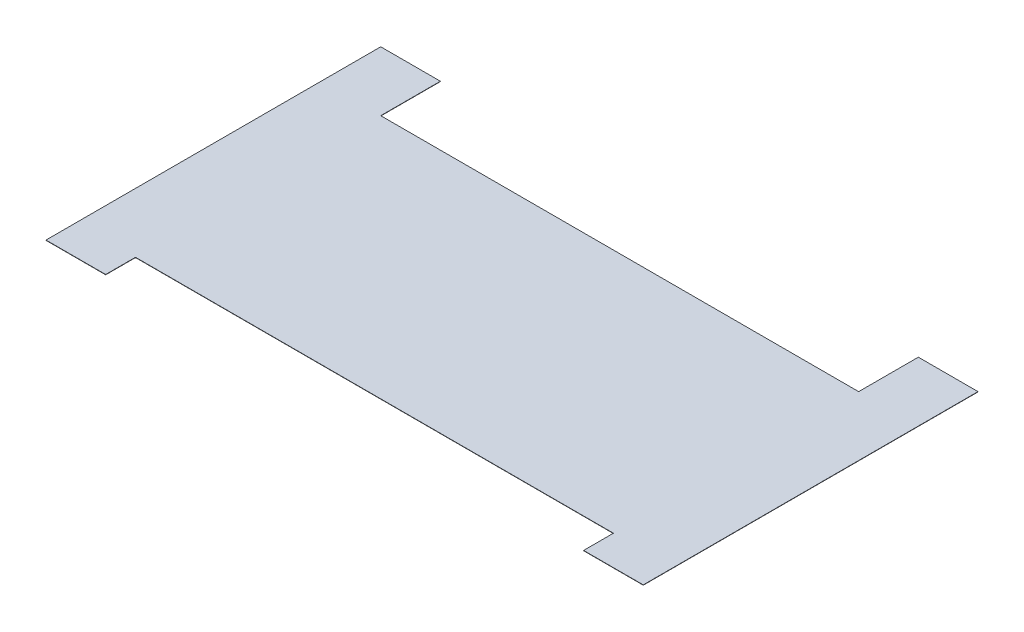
ISO-10303-21;
HEADER;
FILE_DESCRIPTION(('STEP AP214'),'2;1');
FILE_NAME('part.step','',(''),(''),'','','');
FILE_SCHEMA(('AUTOMOTIVE_DESIGN { 1 0 10303 214 1 1 1 1 }'));
ENDSEC;
DATA;
#1=APPLICATION_CONTEXT('core data for automotive mechanical design processes');
#2=APPLICATION_PROTOCOL_DEFINITION('international standard','automotive_design',2000,#1);
#3=PRODUCT_CONTEXT('',#1,'mechanical');
#4=PRODUCT('Part','Part','',(#3));
#5=PRODUCT_RELATED_PRODUCT_CATEGORY('part','',(#4));
#6=PRODUCT_DEFINITION_FORMATION('','',#4);
#7=PRODUCT_DEFINITION_CONTEXT('part definition',#1,'design');
#8=PRODUCT_DEFINITION('design','',#6,#7);
#9=PRODUCT_DEFINITION_SHAPE('','',#8);
#10=(LENGTH_UNIT() NAMED_UNIT(*) SI_UNIT(.MILLI.,.METRE.));
#11=(NAMED_UNIT(*) PLANE_ANGLE_UNIT() SI_UNIT($,.RADIAN.));
#12=(NAMED_UNIT(*) SI_UNIT($,.STERADIAN.) SOLID_ANGLE_UNIT());
#13=UNCERTAINTY_MEASURE_WITH_UNIT(LENGTH_MEASURE(1.E-05),#10,'distance_accuracy_value','');
#14=(GEOMETRIC_REPRESENTATION_CONTEXT(3) GLOBAL_UNCERTAINTY_ASSIGNED_CONTEXT((#13)) GLOBAL_UNIT_ASSIGNED_CONTEXT((#10,
#11,#12)) REPRESENTATION_CONTEXT('',''));
#15=CARTESIAN_POINT('',(0.,0.,0.));
#16=DIRECTION('',(0.,0.,1.));
#17=DIRECTION('',(1.,0.,0.));
#18=AXIS2_PLACEMENT_3D('',#15,#16,#17);
#19=CARTESIAN_POINT('',(10.,0.05,0.));
#20=DIRECTION('',(0.,0.,-1.));
#21=DIRECTION('',(-1.,0.,0.));
#22=AXIS2_PLACEMENT_3D('',#19,#20,#21);
#23=PLANE('',#22);
#24=DIRECTION('',(1.,0.,0.));
#25=VECTOR('',#24,1.);
#26=CARTESIAN_POINT('',(10.,0.,0.));
#27=LINE('',#26,#25);
#28=CARTESIAN_POINT('',(0.,0.,0.));
#29=VERTEX_POINT('',#28);
#30=CARTESIAN_POINT('',(10.,0.,0.));
#31=VERTEX_POINT('',#30);
#32=EDGE_CURVE('E157',#29,#31,#27,.T.);
#33=ORIENTED_EDGE('',*,*,#32,.T.);
#34=DIRECTION('',(0.,-1.,0.));
#35=VECTOR('',#34,1.);
#36=CARTESIAN_POINT('',(10.,0.05,0.));
#37=LINE('',#36,#35);
#38=CARTESIAN_POINT('',(10.,0.05,0.));
#39=VERTEX_POINT('',#38);
#40=EDGE_CURVE('E11',#39,#31,#37,.T.);
#41=ORIENTED_EDGE('',*,*,#40,.F.);
#42=DIRECTION('',(1.,0.,0.));
#43=VECTOR('',#42,1.);
#44=CARTESIAN_POINT('',(10.,0.05,0.));
#45=LINE('',#44,#43);
#46=CARTESIAN_POINT('',(0.,0.05,0.));
#47=VERTEX_POINT('',#46);
#48=EDGE_CURVE('E179',#47,#39,#45,.T.);
#49=ORIENTED_EDGE('',*,*,#48,.F.);
#50=DIRECTION('',(0.,-1.,0.));
#51=VECTOR('',#50,1.);
#52=CARTESIAN_POINT('',(0.,0.05,0.));
#53=LINE('',#52,#51);
#54=EDGE_CURVE('E153',#47,#29,#53,.T.);
#55=ORIENTED_EDGE('',*,*,#54,.T.);
#56=EDGE_LOOP('',(#33,#41,#49,#55));
#57=FACE_BOUND('',#56,.T.);
#58=ADVANCED_FACE('F37',(#57),#23,.F.);
#59=CARTESIAN_POINT('',(10.,0.05,-4.99999999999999));
#60=DIRECTION('',(-1.,0.,0.));
#61=DIRECTION('',(0.,0.,1.));
#62=AXIS2_PLACEMENT_3D('',#59,#60,#61);
#63=PLANE('',#62);
#64=DIRECTION('',(0.,0.,-1.));
#65=VECTOR('',#64,1.);
#66=CARTESIAN_POINT('',(10.,0.,-4.99999999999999));
#67=LINE('',#66,#65);
#68=CARTESIAN_POINT('',(10.,0.,-4.99999999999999));
#69=VERTEX_POINT('',#68);
#70=EDGE_CURVE('E160',#31,#69,#67,.T.);
#71=ORIENTED_EDGE('',*,*,#70,.T.);
#72=DIRECTION('',(0.,-1.,0.));
#73=VECTOR('',#72,1.);
#74=CARTESIAN_POINT('',(10.,0.05,-4.99999999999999));
#75=LINE('',#74,#73);
#76=CARTESIAN_POINT('',(10.,0.05,-4.99999999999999));
#77=VERTEX_POINT('',#76);
#78=EDGE_CURVE('E45',#77,#69,#75,.T.);
#79=ORIENTED_EDGE('',*,*,#78,.F.);
#80=DIRECTION('',(0.,0.,-1.));
#81=VECTOR('',#80,1.);
#82=CARTESIAN_POINT('',(10.,0.05,-4.99999999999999));
#83=LINE('',#82,#81);
#84=EDGE_CURVE('E108',#39,#77,#83,.T.);
#85=ORIENTED_EDGE('',*,*,#84,.F.);
#86=ORIENTED_EDGE('',*,*,#40,.T.);
#87=EDGE_LOOP('',(#71,#79,#85,#86));
#88=FACE_BOUND('',#87,.T.);
#89=ADVANCED_FACE('F257',(#88),#63,.F.);
#90=CARTESIAN_POINT('',(90.1,0.05,-5.));
#91=DIRECTION('',(0.,0.,-1.));
#92=DIRECTION('',(-1.,0.,0.));
#93=AXIS2_PLACEMENT_3D('',#90,#91,#92);
#94=PLANE('',#93);
#95=DIRECTION('',(1.,0.,0.));
#96=VECTOR('',#95,1.);
#97=CARTESIAN_POINT('',(90.1,0.,-5.));
#98=LINE('',#97,#96);
#99=CARTESIAN_POINT('',(90.1,0.,-5.));
#100=VERTEX_POINT('',#99);
#101=EDGE_CURVE('E162',#69,#100,#98,.T.);
#102=ORIENTED_EDGE('',*,*,#101,.T.);
#103=DIRECTION('',(0.,-1.,0.));
#104=VECTOR('',#103,1.);
#105=CARTESIAN_POINT('',(90.1,0.05,-5.));
#106=LINE('',#105,#104);
#107=CARTESIAN_POINT('',(90.1,0.05,-5.));
#108=VERTEX_POINT('',#107);
#109=EDGE_CURVE('E198',#108,#100,#106,.T.);
#110=ORIENTED_EDGE('',*,*,#109,.F.);
#111=DIRECTION('',(1.,0.,0.));
#112=VECTOR('',#111,1.);
#113=CARTESIAN_POINT('',(90.1,0.05,-5.));
#114=LINE('',#113,#112);
#115=EDGE_CURVE('E206',#77,#108,#114,.T.);
#116=ORIENTED_EDGE('',*,*,#115,.F.);
#117=ORIENTED_EDGE('',*,*,#78,.T.);
#118=EDGE_LOOP('',(#102,#110,#116,#117));
#119=FACE_BOUND('',#118,.T.);
#120=ADVANCED_FACE('F204',(#119),#94,.F.);
#121=CARTESIAN_POINT('',(90.1,0.05,0.));
#122=DIRECTION('',(1.,0.,0.));
#123=DIRECTION('',(0.,0.,-1.));
#124=AXIS2_PLACEMENT_3D('',#121,#122,#123);
#125=PLANE('',#124);
#126=DIRECTION('',(0.,0.,1.));
#127=VECTOR('',#126,1.);
#128=CARTESIAN_POINT('',(90.1,0.,0.));
#129=LINE('',#128,#127);
#130=CARTESIAN_POINT('',(90.1,0.,0.));
#131=VERTEX_POINT('',#130);
#132=EDGE_CURVE('E164',#100,#131,#129,.T.);
#133=ORIENTED_EDGE('',*,*,#132,.T.);
#134=DIRECTION('',(0.,-1.,0.));
#135=VECTOR('',#134,1.);
#136=CARTESIAN_POINT('',(90.1,0.05,0.));
#137=LINE('',#136,#135);
#138=CARTESIAN_POINT('',(90.1,0.05,0.));
#139=VERTEX_POINT('',#138);
#140=EDGE_CURVE('E195',#139,#131,#137,.T.);
#141=ORIENTED_EDGE('',*,*,#140,.F.);
#142=DIRECTION('',(0.,0.,1.));
#143=VECTOR('',#142,1.);
#144=CARTESIAN_POINT('',(90.1,0.05,0.));
#145=LINE('',#144,#143);
#146=EDGE_CURVE('E224',#108,#139,#145,.T.);
#147=ORIENTED_EDGE('',*,*,#146,.F.);
#148=ORIENTED_EDGE('',*,*,#109,.T.);
#149=EDGE_LOOP('',(#133,#141,#147,#148));
#150=FACE_BOUND('',#149,.T.);
#151=ADVANCED_FACE('F215',(#150),#125,.F.);
#152=CARTESIAN_POINT('',(100.1,0.05,0.));
#153=DIRECTION('',(0.,0.,-1.));
#154=DIRECTION('',(-1.,0.,0.));
#155=AXIS2_PLACEMENT_3D('',#152,#153,#154);
#156=PLANE('',#155);
#157=DIRECTION('',(1.,0.,0.));
#158=VECTOR('',#157,1.);
#159=CARTESIAN_POINT('',(100.1,0.,0.));
#160=LINE('',#159,#158);
#161=CARTESIAN_POINT('',(100.1,0.,0.));
#162=VERTEX_POINT('',#161);
#163=EDGE_CURVE('E166',#131,#162,#160,.T.);
#164=ORIENTED_EDGE('',*,*,#163,.T.);
#165=DIRECTION('',(0.,-1.,0.));
#166=VECTOR('',#165,1.);
#167=CARTESIAN_POINT('',(100.1,0.05,0.));
#168=LINE('',#167,#166);
#169=CARTESIAN_POINT('',(100.1,0.05,0.));
#170=VERTEX_POINT('',#169);
#171=EDGE_CURVE('E192',#170,#162,#168,.T.);
#172=ORIENTED_EDGE('',*,*,#171,.F.);
#173=DIRECTION('',(1.,0.,0.));
#174=VECTOR('',#173,1.);
#175=CARTESIAN_POINT('',(100.1,0.05,0.));
#176=LINE('',#175,#174);
#177=EDGE_CURVE('E221',#139,#170,#176,.T.);
#178=ORIENTED_EDGE('',*,*,#177,.F.);
#179=ORIENTED_EDGE('',*,*,#140,.T.);
#180=EDGE_LOOP('',(#164,#172,#178,#179));
#181=FACE_BOUND('',#180,.T.);
#182=ADVANCED_FACE('F219',(#181),#156,.F.);
#183=CARTESIAN_POINT('',(100.1,0.05,-56.1));
#184=DIRECTION('',(-1.,0.,0.));
#185=DIRECTION('',(0.,0.,1.));
#186=AXIS2_PLACEMENT_3D('',#183,#184,#185);
#187=PLANE('',#186);
#188=DIRECTION('',(0.,0.,-1.));
#189=VECTOR('',#188,1.);
#190=CARTESIAN_POINT('',(100.1,0.,-56.1));
#191=LINE('',#190,#189);
#192=CARTESIAN_POINT('',(100.1,0.,-56.1));
#193=VERTEX_POINT('',#192);
#194=EDGE_CURVE('E168',#162,#193,#191,.T.);
#195=ORIENTED_EDGE('',*,*,#194,.T.);
#196=DIRECTION('',(0.,-1.,0.));
#197=VECTOR('',#196,1.);
#198=CARTESIAN_POINT('',(100.1,0.05,-56.1));
#199=LINE('',#198,#197);
#200=CARTESIAN_POINT('',(100.1,0.05,-56.1));
#201=VERTEX_POINT('',#200);
#202=EDGE_CURVE('E189',#201,#193,#199,.T.);
#203=ORIENTED_EDGE('',*,*,#202,.F.);
#204=DIRECTION('',(0.,0.,-1.));
#205=VECTOR('',#204,1.);
#206=CARTESIAN_POINT('',(100.1,0.05,-56.1));
#207=LINE('',#206,#205);
#208=EDGE_CURVE('E223',#170,#201,#207,.T.);
#209=ORIENTED_EDGE('',*,*,#208,.F.);
#210=ORIENTED_EDGE('',*,*,#171,.T.);
#211=EDGE_LOOP('',(#195,#203,#209,#210));
#212=FACE_BOUND('',#211,.T.);
#213=ADVANCED_FACE('F270',(#212),#187,.F.);
#214=CARTESIAN_POINT('',(90.1,0.05,-56.1));
#215=DIRECTION('',(0.,0.,1.));
#216=DIRECTION('',(1.,0.,0.));
#217=AXIS2_PLACEMENT_3D('',#214,#215,#216);
#218=PLANE('',#217);
#219=DIRECTION('',(-1.,0.,0.));
#220=VECTOR('',#219,1.);
#221=CARTESIAN_POINT('',(90.1,0.,-56.1));
#222=LINE('',#221,#220);
#223=CARTESIAN_POINT('',(90.1,0.,-56.1));
#224=VERTEX_POINT('',#223);
#225=EDGE_CURVE('E170',#193,#224,#222,.T.);
#226=ORIENTED_EDGE('',*,*,#225,.T.);
#227=DIRECTION('',(0.,-1.,0.));
#228=VECTOR('',#227,1.);
#229=CARTESIAN_POINT('',(90.1,0.05,-56.1));
#230=LINE('',#229,#228);
#231=CARTESIAN_POINT('',(90.1,0.05,-56.1));
#232=VERTEX_POINT('',#231);
#233=EDGE_CURVE('E186',#232,#224,#230,.T.);
#234=ORIENTED_EDGE('',*,*,#233,.F.);
#235=DIRECTION('',(-1.,0.,0.));
#236=VECTOR('',#235,1.);
#237=CARTESIAN_POINT('',(90.1,0.05,-56.1));
#238=LINE('',#237,#236);
#239=EDGE_CURVE('E226',#201,#232,#238,.T.);
#240=ORIENTED_EDGE('',*,*,#239,.F.);
#241=ORIENTED_EDGE('',*,*,#202,.T.);
#242=EDGE_LOOP('',(#226,#234,#240,#241));
#243=FACE_BOUND('',#242,.T.);
#244=ADVANCED_FACE('F273',(#243),#218,.F.);
#245=CARTESIAN_POINT('',(90.1,0.05,-46.1));
#246=DIRECTION('',(1.,0.,0.));
#247=DIRECTION('',(0.,0.,-1.));
#248=AXIS2_PLACEMENT_3D('',#245,#246,#247);
#249=PLANE('',#248);
#250=DIRECTION('',(0.,0.,1.));
#251=VECTOR('',#250,1.);
#252=CARTESIAN_POINT('',(90.1,0.,-46.1));
#253=LINE('',#252,#251);
#254=CARTESIAN_POINT('',(90.1,0.,-46.1));
#255=VERTEX_POINT('',#254);
#256=EDGE_CURVE('E172',#224,#255,#253,.T.);
#257=ORIENTED_EDGE('',*,*,#256,.T.);
#258=DIRECTION('',(0.,-1.,0.));
#259=VECTOR('',#258,1.);
#260=CARTESIAN_POINT('',(90.1,0.05,-46.1));
#261=LINE('',#260,#259);
#262=CARTESIAN_POINT('',(90.1,0.05,-46.1));
#263=VERTEX_POINT('',#262);
#264=EDGE_CURVE('E183',#263,#255,#261,.T.);
#265=ORIENTED_EDGE('',*,*,#264,.F.);
#266=DIRECTION('',(0.,0.,1.));
#267=VECTOR('',#266,1.);
#268=CARTESIAN_POINT('',(90.1,0.05,-46.1));
#269=LINE('',#268,#267);
#270=EDGE_CURVE('E232',#232,#263,#269,.T.);
#271=ORIENTED_EDGE('',*,*,#270,.F.);
#272=ORIENTED_EDGE('',*,*,#233,.T.);
#273=EDGE_LOOP('',(#257,#265,#271,#272));
#274=FACE_BOUND('',#273,.T.);
#275=ADVANCED_FACE('F238',(#274),#249,.F.);
#276=CARTESIAN_POINT('',(10.,0.05,-46.1));
#277=DIRECTION('',(0.,0.,1.));
#278=DIRECTION('',(1.,0.,0.));
#279=AXIS2_PLACEMENT_3D('',#276,#277,#278);
#280=PLANE('',#279);
#281=DIRECTION('',(-1.,0.,0.));
#282=VECTOR('',#281,1.);
#283=CARTESIAN_POINT('',(10.,0.,-46.1));
#284=LINE('',#283,#282);
#285=CARTESIAN_POINT('',(10.,0.,-46.1));
#286=VERTEX_POINT('',#285);
#287=EDGE_CURVE('E174',#255,#286,#284,.T.);
#288=ORIENTED_EDGE('',*,*,#287,.T.);
#289=DIRECTION('',(0.,-1.,0.));
#290=VECTOR('',#289,1.);
#291=CARTESIAN_POINT('',(10.,0.05,-46.1));
#292=LINE('',#291,#290);
#293=CARTESIAN_POINT('',(10.,0.05,-46.1));
#294=VERTEX_POINT('',#293);
#295=EDGE_CURVE('E148',#294,#286,#292,.T.);
#296=ORIENTED_EDGE('',*,*,#295,.F.);
#297=DIRECTION('',(-1.,0.,0.));
#298=VECTOR('',#297,1.);
#299=CARTESIAN_POINT('',(10.,0.05,-46.1));
#300=LINE('',#299,#298);
#301=EDGE_CURVE('E139',#263,#294,#300,.T.);
#302=ORIENTED_EDGE('',*,*,#301,.F.);
#303=ORIENTED_EDGE('',*,*,#264,.T.);
#304=EDGE_LOOP('',(#288,#296,#302,#303));
#305=FACE_BOUND('',#304,.T.);
#306=ADVANCED_FACE('F242',(#305),#280,.F.);
#307=CARTESIAN_POINT('',(10.,0.05,-56.1));
#308=DIRECTION('',(-1.,0.,0.));
#309=DIRECTION('',(0.,0.,1.));
#310=AXIS2_PLACEMENT_3D('',#307,#308,#309);
#311=PLANE('',#310);
#312=DIRECTION('',(0.,0.,-1.));
#313=VECTOR('',#312,1.);
#314=CARTESIAN_POINT('',(10.,0.,-56.1));
#315=LINE('',#314,#313);
#316=CARTESIAN_POINT('',(10.,0.,-56.1));
#317=VERTEX_POINT('',#316);
#318=EDGE_CURVE('E147',#286,#317,#315,.T.);
#319=ORIENTED_EDGE('',*,*,#318,.T.);
#320=DIRECTION('',(0.,-1.,0.));
#321=VECTOR('',#320,1.);
#322=CARTESIAN_POINT('',(10.,0.05,-56.1));
#323=LINE('',#322,#321);
#324=CARTESIAN_POINT('',(10.,0.05,-56.1));
#325=VERTEX_POINT('',#324);
#326=EDGE_CURVE('E144',#325,#317,#323,.T.);
#327=ORIENTED_EDGE('',*,*,#326,.F.);
#328=DIRECTION('',(0.,0.,-1.));
#329=VECTOR('',#328,1.);
#330=CARTESIAN_POINT('',(10.,0.05,-56.1));
#331=LINE('',#330,#329);
#332=EDGE_CURVE('E133',#294,#325,#331,.T.);
#333=ORIENTED_EDGE('',*,*,#332,.F.);
#334=ORIENTED_EDGE('',*,*,#295,.T.);
#335=EDGE_LOOP('',(#319,#327,#333,#334));
#336=FACE_BOUND('',#335,.T.);
#337=ADVANCED_FACE('F145',(#336),#311,.F.);
#338=CARTESIAN_POINT('',(0.,0.05,-56.1));
#339=DIRECTION('',(0.,0.,1.));
#340=DIRECTION('',(1.,0.,0.));
#341=AXIS2_PLACEMENT_3D('',#338,#339,#340);
#342=PLANE('',#341);
#343=DIRECTION('',(-1.,0.,0.));
#344=VECTOR('',#343,1.);
#345=CARTESIAN_POINT('',(0.,0.,-56.1));
#346=LINE('',#345,#344);
#347=CARTESIAN_POINT('',(0.,0.,-56.1));
#348=VERTEX_POINT('',#347);
#349=EDGE_CURVE('E94',#317,#348,#346,.T.);
#350=ORIENTED_EDGE('',*,*,#349,.T.);
#351=DIRECTION('',(0.,-1.,0.));
#352=VECTOR('',#351,1.);
#353=CARTESIAN_POINT('',(0.,0.05,-56.1));
#354=LINE('',#353,#352);
#355=CARTESIAN_POINT('',(0.,0.05,-56.1));
#356=VERTEX_POINT('',#355);
#357=EDGE_CURVE('E149',#356,#348,#354,.T.);
#358=ORIENTED_EDGE('',*,*,#357,.F.);
#359=DIRECTION('',(-1.,0.,0.));
#360=VECTOR('',#359,1.);
#361=CARTESIAN_POINT('',(0.,0.05,-56.1));
#362=LINE('',#361,#360);
#363=EDGE_CURVE('E137',#325,#356,#362,.T.);
#364=ORIENTED_EDGE('',*,*,#363,.F.);
#365=ORIENTED_EDGE('',*,*,#326,.T.);
#366=EDGE_LOOP('',(#350,#358,#364,#365));
#367=FACE_BOUND('',#366,.T.);
#368=ADVANCED_FACE('F151',(#367),#342,.F.);
#369=CARTESIAN_POINT('',(0.,0.05,0.));
#370=DIRECTION('',(1.,0.,0.));
#371=DIRECTION('',(0.,0.,-1.));
#372=AXIS2_PLACEMENT_3D('',#369,#370,#371);
#373=PLANE('',#372);
#374=DIRECTION('',(0.,0.,1.));
#375=VECTOR('',#374,1.);
#376=CARTESIAN_POINT('',(0.,0.,0.));
#377=LINE('',#376,#375);
#378=EDGE_CURVE('E100',#348,#29,#377,.T.);
#379=ORIENTED_EDGE('',*,*,#378,.T.);
#380=ORIENTED_EDGE('',*,*,#54,.F.);
#381=DIRECTION('',(0.,0.,1.));
#382=VECTOR('',#381,1.);
#383=CARTESIAN_POINT('',(0.,0.05,0.));
#384=LINE('',#383,#382);
#385=EDGE_CURVE('E53',#356,#47,#384,.T.);
#386=ORIENTED_EDGE('',*,*,#385,.F.);
#387=ORIENTED_EDGE('',*,*,#357,.T.);
#388=EDGE_LOOP('',(#379,#380,#386,#387));
#389=FACE_BOUND('',#388,.T.);
#390=ADVANCED_FACE('F246',(#389),#373,.F.);
#391=CARTESIAN_POINT('',(0.,0.05,0.));
#392=DIRECTION('',(0.,-1.,0.));
#393=DIRECTION('',(0.,0.,-1.));
#394=AXIS2_PLACEMENT_3D('',#391,#392,#393);
#395=PLANE('',#394);
#396=ORIENTED_EDGE('',*,*,#48,.T.);
#397=ORIENTED_EDGE('',*,*,#84,.T.);
#398=ORIENTED_EDGE('',*,*,#115,.T.);
#399=ORIENTED_EDGE('',*,*,#146,.T.);
#400=ORIENTED_EDGE('',*,*,#177,.T.);
#401=ORIENTED_EDGE('',*,*,#208,.T.);
#402=ORIENTED_EDGE('',*,*,#239,.T.);
#403=ORIENTED_EDGE('',*,*,#270,.T.);
#404=ORIENTED_EDGE('',*,*,#301,.T.);
#405=ORIENTED_EDGE('',*,*,#332,.T.);
#406=ORIENTED_EDGE('',*,*,#363,.T.);
#407=ORIENTED_EDGE('',*,*,#385,.T.);
#408=EDGE_LOOP('',(#396,#397,#398,#399,#400,#401,#402,#403,#404,#405,#406,#407));
#409=FACE_BOUND('',#408,.T.);
#410=ADVANCED_FACE('F135',(#409),#395,.F.);
#411=CARTESIAN_POINT('',(0.,0.,0.));
#412=DIRECTION('',(0.,-1.,0.));
#413=DIRECTION('',(0.,0.,-1.));
#414=AXIS2_PLACEMENT_3D('',#411,#412,#413);
#415=PLANE('',#414);
#416=ORIENTED_EDGE('',*,*,#32,.F.);
#417=ORIENTED_EDGE('',*,*,#378,.F.);
#418=ORIENTED_EDGE('',*,*,#349,.F.);
#419=ORIENTED_EDGE('',*,*,#318,.F.);
#420=ORIENTED_EDGE('',*,*,#287,.F.);
#421=ORIENTED_EDGE('',*,*,#256,.F.);
#422=ORIENTED_EDGE('',*,*,#225,.F.);
#423=ORIENTED_EDGE('',*,*,#194,.F.);
#424=ORIENTED_EDGE('',*,*,#163,.F.);
#425=ORIENTED_EDGE('',*,*,#132,.F.);
#426=ORIENTED_EDGE('',*,*,#101,.F.);
#427=ORIENTED_EDGE('',*,*,#70,.F.);
#428=EDGE_LOOP('',(#416,#417,#418,#419,#420,#421,#422,#423,#424,#425,#426,#427));
#429=FACE_BOUND('',#428,.T.);
#430=ADVANCED_FACE('F210',(#429),#415,.T.);
#431=CLOSED_SHELL('',(#58,#89,#120,#151,#182,#213,#244,#275,#306,#337,#368,#390,#410,#430));
#432=MANIFOLD_SOLID_BREP('B2',#431);
#433=ADVANCED_BREP_SHAPE_REPRESENTATION('',(#18,#432),#14);
#434=SHAPE_DEFINITION_REPRESENTATION(#9,#433);
ENDSEC;
END-ISO-10303-21;
